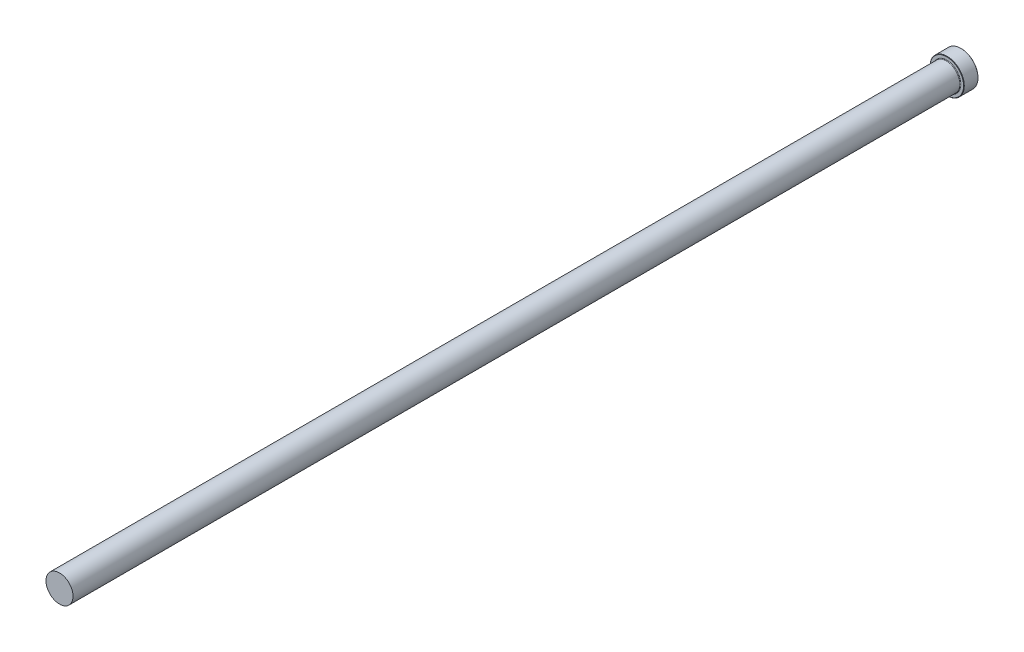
from build123d import *

# Parameters (mm, degrees)
CHAMFER1_SIZE = 0.2


with BuildPart() as part:
    # Sketch1 → Revolve1 (revolve)
    with BuildSketch(Plane(origin=(0, 0, 0), x_dir=(0, 0, -1), z_dir=(1, 0, 0)), mode=Mode.PRIVATE) as revolve1_sk:
        with BuildLine():
            Line((0, 0), (0, 9.5))
            Line((0, 9.5), (-8, 9.5))
            Line((-8, 9.5), (-8, 7.8))
            ThreePointArc((-8, 7.8), (-8.087867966, 7.587867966), (-8.3, 7.5))
            Line((-8.3, 7.5), (-500, 7.5))
            Line((-500, 7.5), (-500, 0))
            Line((-500, 0), (0, 0))
        make_face()
    revolve(revolve1_sk.sketch.rotate(Axis((0, 0, 109.05062828), (0, 0, -1)), 90), axis=Axis((0, 0, 109.05062828), (0, 0, -1)))

    # Chamfer1
    chamfer1_edges = [part.edges().sort_by_distance(p)[0] for p in [
        (-9.5, 0, 0),
        (-9.5, 0, 8),
    ]]
    chamfer(chamfer1_edges, length=CHAMFER1_SIZE)


solid = part.part
